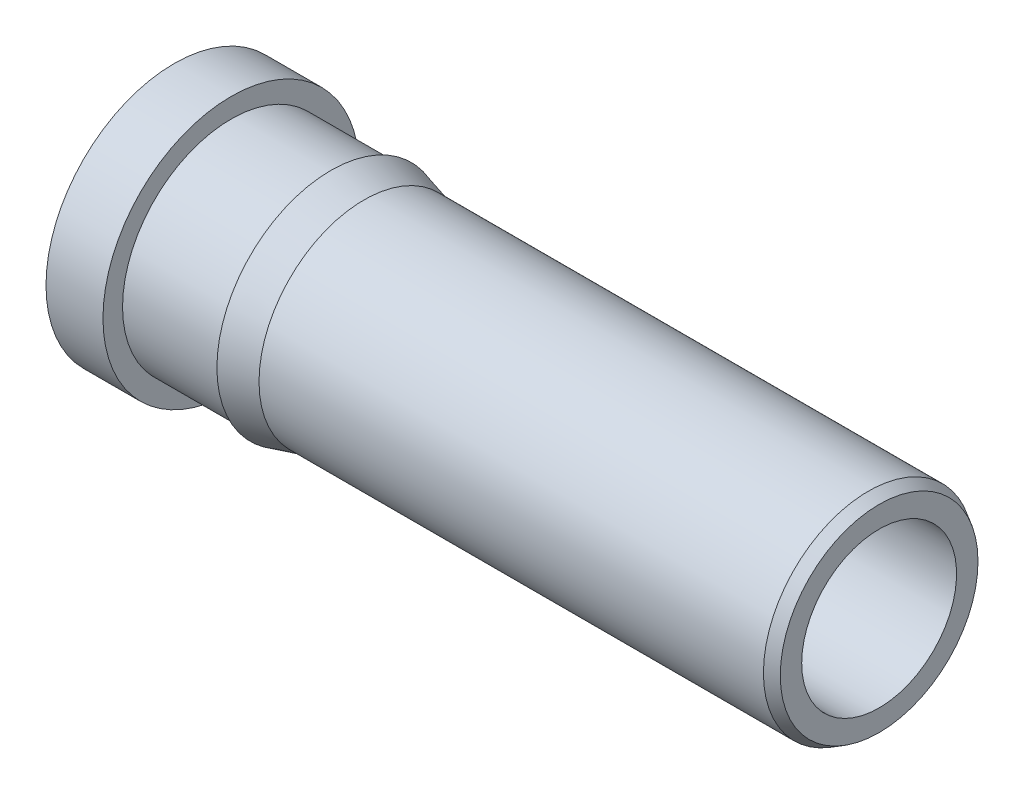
from build123d import *

# Parameters (mm, degrees)
HOLE1_D     = 1.2954
HOLE1_DEPTH = 2.3368
HOLE1_TIP   = 0.389177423
HOLE2_D     = 1.1049
HOLE2_DEPTH = 5.0292
HOLE2_TIP   = 0.331945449


with BuildPart() as part:
    # Sketch1 → RevolutionAngle1 (revolve)
    with BuildSketch(Plane.XY, mode=Mode.PRIVATE) as revolutionangle1_sk:
        Polygon((0, 0), (0, 0.9144), (0.4064, 0.9144), (0.4064, 0.7747), (1.1176, 0.7747), (1.1176, 0.8128), (1.354585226, 0.7493), (4.953, 0.7493), (5.0292, 0.705305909), (5.0292, 0), align=None)
    revolve(revolutionangle1_sk.sketch.rotate(Axis((0, 0, 0), (1, 0, 0)), 90), axis=Axis((0, 0, 0), (1, 0, 0)))

    # Hole1
    with Locations(Plane.ZY):
        with Locations((0, 0)):
            Hole(HOLE1_D / 2, depth=HOLE1_DEPTH)
            with Locations((0, 0, -(HOLE1_DEPTH + HOLE1_TIP / 2))):  # 118° drill point
                Cone(0, HOLE1_D / 2, HOLE1_TIP, mode=Mode.SUBTRACT)

    # Hole2
    with Locations(Plane(origin=(0, 0.341908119, -0.685195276), x_dir=(0, 0, 1), z_dir=(-1, 0, 0))):
        with Locations((0.685195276, -0.341908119)):
            Hole(HOLE2_D / 2, depth=HOLE2_DEPTH)
            with Locations((0, 0, -(HOLE2_DEPTH + HOLE2_TIP / 2))):  # 118° drill point
                Cone(0, HOLE2_D / 2, HOLE2_TIP, mode=Mode.SUBTRACT)


solid = part.part
